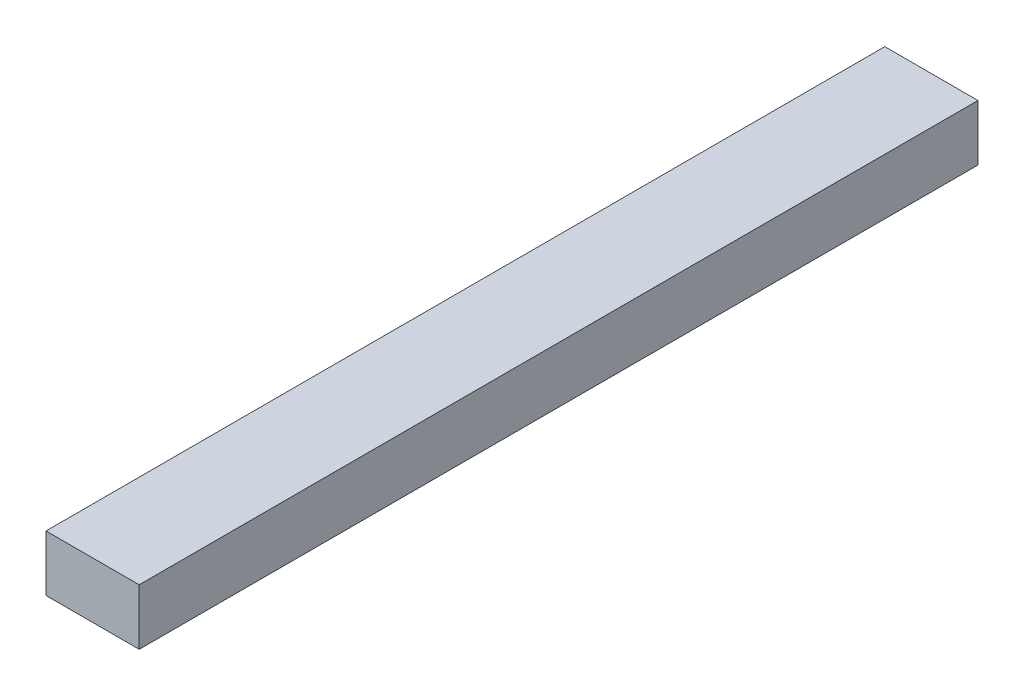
from build123d import *

# Parameters (mm, degrees)
SKETCH1_W           = 5
SKETCH1_H           = 3
BOSS_EXTRUDE1_DEPTH = 45


with BuildPart() as part:
    # Sketch1 → Boss-Extrude1 (new body)
    with BuildSketch(Plane.XY):
        Rectangle(SKETCH1_W, SKETCH1_H)
    extrude(amount=BOSS_EXTRUDE1_DEPTH)


solid = part.part
